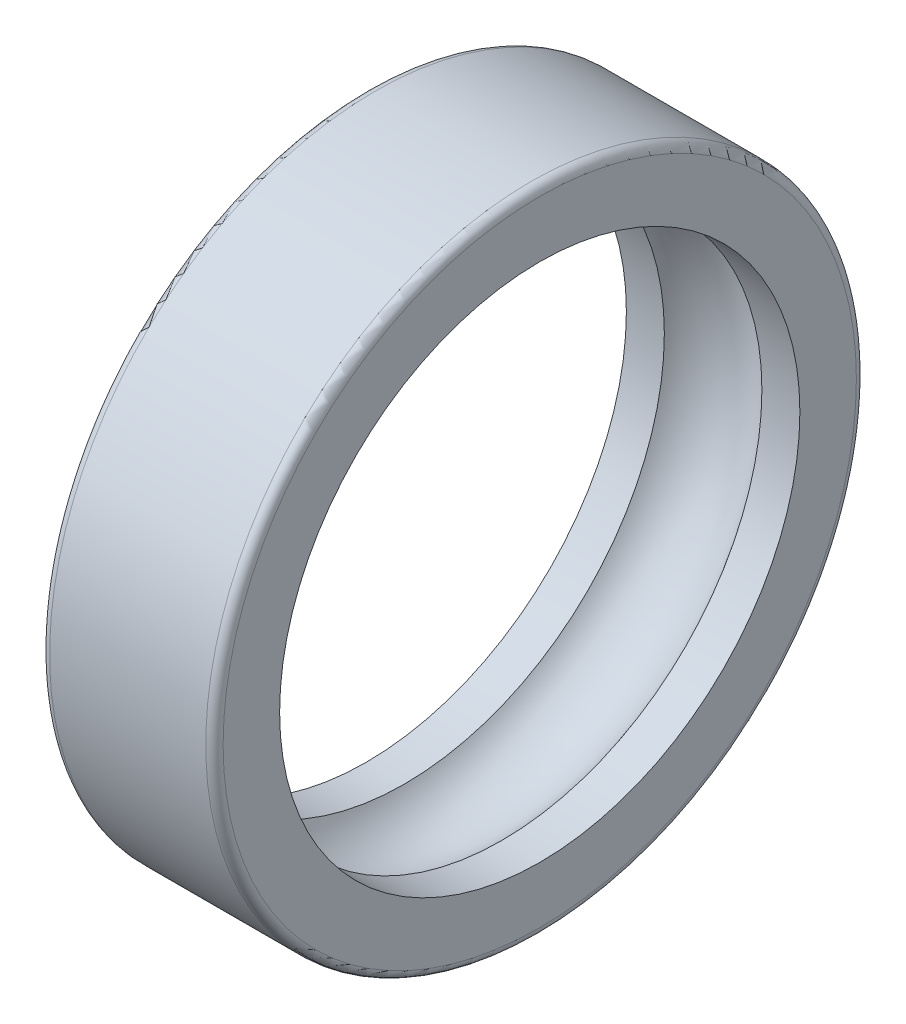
from build123d import *


with BuildPart() as part:
    # Esquisse1 → R_volution1 (revolve)
    with BuildSketch(Plane.XY, mode=Mode.PRIVATE) as r_volution1_sk:
        with BuildLine():
            Line((0, 14.6), (0, 11.994))
            Line((0, 11.994), (1.751008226, 11.994))
            ThreePointArc((1.751008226, 11.994), (4, 13.2), (6.248991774, 11.994))
            Line((6.248991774, 11.994), (8, 11.994))
            Line((8, 11.994), (8, 14.6))
            ThreePointArc((8, 14.6), (7.882842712, 14.882842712), (7.6, 15))
            Line((7.6, 15), (0.4, 15))
            ThreePointArc((0.4, 15), (0.117157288, 14.882842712), (0, 14.6))
        make_face()
    revolve(r_volution1_sk.sketch.rotate(Axis((8, 0, 0), (-1, 0, 0)), 180), axis=Axis((8, 0, 0), (-1, 0, 0)))


solid = part.part
